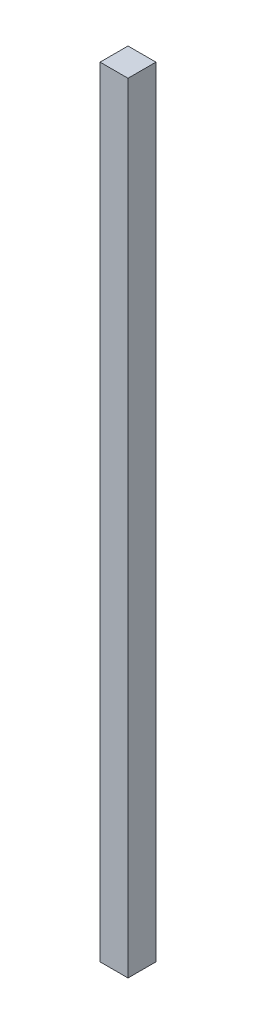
ISO-10303-21;
HEADER;
FILE_DESCRIPTION(('STEP AP214'),'2;1');
FILE_NAME('part.step','',(''),(''),'','','');
FILE_SCHEMA(('AUTOMOTIVE_DESIGN { 1 0 10303 214 1 1 1 1 }'));
ENDSEC;
DATA;
#1=APPLICATION_CONTEXT('core data for automotive mechanical design processes');
#2=APPLICATION_PROTOCOL_DEFINITION('international standard','automotive_design',2000,#1);
#3=PRODUCT_CONTEXT('',#1,'mechanical');
#4=PRODUCT('Part','Part','',(#3));
#5=PRODUCT_RELATED_PRODUCT_CATEGORY('part','',(#4));
#6=PRODUCT_DEFINITION_FORMATION('','',#4);
#7=PRODUCT_DEFINITION_CONTEXT('part definition',#1,'design');
#8=PRODUCT_DEFINITION('design','',#6,#7);
#9=PRODUCT_DEFINITION_SHAPE('','',#8);
#10=(LENGTH_UNIT() NAMED_UNIT(*) SI_UNIT(.MILLI.,.METRE.));
#11=(NAMED_UNIT(*) PLANE_ANGLE_UNIT() SI_UNIT($,.RADIAN.));
#12=(NAMED_UNIT(*) SI_UNIT($,.STERADIAN.) SOLID_ANGLE_UNIT());
#13=UNCERTAINTY_MEASURE_WITH_UNIT(LENGTH_MEASURE(1.E-05),#10,'distance_accuracy_value','');
#14=(GEOMETRIC_REPRESENTATION_CONTEXT(3) GLOBAL_UNCERTAINTY_ASSIGNED_CONTEXT((#13)) GLOBAL_UNIT_ASSIGNED_CONTEXT((#10,
#11,#12)) REPRESENTATION_CONTEXT('',''));
#15=CARTESIAN_POINT('',(0.,0.,0.));
#16=DIRECTION('',(0.,0.,1.));
#17=DIRECTION('',(1.,0.,0.));
#18=AXIS2_PLACEMENT_3D('',#15,#16,#17);
#19=CARTESIAN_POINT('',(0.,0.,24.));
#20=DIRECTION('',(1.,0.,0.));
#21=DIRECTION('',(0.,0.,-1.));
#22=AXIS2_PLACEMENT_3D('',#19,#20,#21);
#23=PLANE('',#22);
#24=DIRECTION('',(0.,-1.,0.));
#25=VECTOR('',#24,1.);
#26=CARTESIAN_POINT('',(0.,0.,0.));
#27=LINE('',#26,#25);
#28=CARTESIAN_POINT('',(0.,670.,0.));
#29=VERTEX_POINT('',#28);
#30=CARTESIAN_POINT('',(0.,0.,0.));
#31=VERTEX_POINT('',#30);
#32=EDGE_CURVE('E96',#29,#31,#27,.T.);
#33=ORIENTED_EDGE('',*,*,#32,.T.);
#34=DIRECTION('',(0.,0.,-1.));
#35=VECTOR('',#34,1.);
#36=CARTESIAN_POINT('',(0.,0.,24.));
#37=LINE('',#36,#35);
#38=CARTESIAN_POINT('',(0.,0.,24.));
#39=VERTEX_POINT('',#38);
#40=EDGE_CURVE('E11',#39,#31,#37,.T.);
#41=ORIENTED_EDGE('',*,*,#40,.F.);
#42=DIRECTION('',(0.,-1.,0.));
#43=VECTOR('',#42,1.);
#44=CARTESIAN_POINT('',(0.,0.,24.));
#45=LINE('',#44,#43);
#46=CARTESIAN_POINT('',(0.,670.,24.));
#47=VERTEX_POINT('',#46);
#48=EDGE_CURVE('E84',#47,#39,#45,.T.);
#49=ORIENTED_EDGE('',*,*,#48,.F.);
#50=DIRECTION('',(0.,0.,-1.));
#51=VECTOR('',#50,1.);
#52=CARTESIAN_POINT('',(0.,670.,24.));
#53=LINE('',#52,#51);
#54=EDGE_CURVE('E92',#47,#29,#53,.T.);
#55=ORIENTED_EDGE('',*,*,#54,.T.);
#56=EDGE_LOOP('',(#33,#41,#49,#55));
#57=FACE_BOUND('',#56,.T.);
#58=ADVANCED_FACE('F33',(#57),#23,.F.);
#59=CARTESIAN_POINT('',(0.,0.,24.));
#60=DIRECTION('',(0.,1.,0.));
#61=DIRECTION('',(0.,0.,1.));
#62=AXIS2_PLACEMENT_3D('',#59,#60,#61);
#63=PLANE('',#62);
#64=DIRECTION('',(1.,0.,0.));
#65=VECTOR('',#64,1.);
#66=CARTESIAN_POINT('',(0.,0.,0.));
#67=LINE('',#66,#65);
#68=CARTESIAN_POINT('',(24.,0.,0.));
#69=VERTEX_POINT('',#68);
#70=EDGE_CURVE('E88',#31,#69,#67,.T.);
#71=ORIENTED_EDGE('',*,*,#70,.T.);
#72=DIRECTION('',(0.,0.,-1.));
#73=VECTOR('',#72,1.);
#74=CARTESIAN_POINT('',(24.,0.,24.));
#75=LINE('',#74,#73);
#76=CARTESIAN_POINT('',(24.,0.,24.));
#77=VERTEX_POINT('',#76);
#78=EDGE_CURVE('E41',#77,#69,#75,.T.);
#79=ORIENTED_EDGE('',*,*,#78,.F.);
#80=DIRECTION('',(1.,0.,0.));
#81=VECTOR('',#80,1.);
#82=CARTESIAN_POINT('',(0.,0.,24.));
#83=LINE('',#82,#81);
#84=EDGE_CURVE('E79',#39,#77,#83,.T.);
#85=ORIENTED_EDGE('',*,*,#84,.F.);
#86=ORIENTED_EDGE('',*,*,#40,.T.);
#87=EDGE_LOOP('',(#71,#79,#85,#86));
#88=FACE_BOUND('',#87,.T.);
#89=ADVANCED_FACE('F87',(#88),#63,.F.);
#90=CARTESIAN_POINT('',(24.,0.,24.));
#91=DIRECTION('',(-1.,0.,0.));
#92=DIRECTION('',(0.,0.,1.));
#93=AXIS2_PLACEMENT_3D('',#90,#91,#92);
#94=PLANE('',#93);
#95=DIRECTION('',(0.,1.,0.));
#96=VECTOR('',#95,1.);
#97=CARTESIAN_POINT('',(24.,0.,0.));
#98=LINE('',#97,#96);
#99=CARTESIAN_POINT('',(24.,670.,0.));
#100=VERTEX_POINT('',#99);
#101=EDGE_CURVE('E66',#69,#100,#98,.T.);
#102=ORIENTED_EDGE('',*,*,#101,.T.);
#103=DIRECTION('',(0.,0.,-1.));
#104=VECTOR('',#103,1.);
#105=CARTESIAN_POINT('',(24.,670.,24.));
#106=LINE('',#105,#104);
#107=CARTESIAN_POINT('',(24.,670.,24.));
#108=VERTEX_POINT('',#107);
#109=EDGE_CURVE('E89',#108,#100,#106,.T.);
#110=ORIENTED_EDGE('',*,*,#109,.F.);
#111=DIRECTION('',(0.,1.,0.));
#112=VECTOR('',#111,1.);
#113=CARTESIAN_POINT('',(24.,0.,24.));
#114=LINE('',#113,#112);
#115=EDGE_CURVE('E82',#77,#108,#114,.T.);
#116=ORIENTED_EDGE('',*,*,#115,.F.);
#117=ORIENTED_EDGE('',*,*,#78,.T.);
#118=EDGE_LOOP('',(#102,#110,#116,#117));
#119=FACE_BOUND('',#118,.T.);
#120=ADVANCED_FACE('F90',(#119),#94,.F.);
#121=CARTESIAN_POINT('',(0.,670.,24.));
#122=DIRECTION('',(0.,-1.,0.));
#123=DIRECTION('',(0.,0.,-1.));
#124=AXIS2_PLACEMENT_3D('',#121,#122,#123);
#125=PLANE('',#124);
#126=DIRECTION('',(-1.,0.,0.));
#127=VECTOR('',#126,1.);
#128=CARTESIAN_POINT('',(0.,670.,0.));
#129=LINE('',#128,#127);
#130=EDGE_CURVE('E72',#100,#29,#129,.T.);
#131=ORIENTED_EDGE('',*,*,#130,.T.);
#132=ORIENTED_EDGE('',*,*,#54,.F.);
#133=DIRECTION('',(-1.,0.,0.));
#134=VECTOR('',#133,1.);
#135=CARTESIAN_POINT('',(0.,670.,24.));
#136=LINE('',#135,#134);
#137=EDGE_CURVE('E49',#108,#47,#136,.T.);
#138=ORIENTED_EDGE('',*,*,#137,.F.);
#139=ORIENTED_EDGE('',*,*,#109,.T.);
#140=EDGE_LOOP('',(#131,#132,#138,#139));
#141=FACE_BOUND('',#140,.T.);
#142=ADVANCED_FACE('F103',(#141),#125,.F.);
#143=CARTESIAN_POINT('',(0.,670.,24.));
#144=DIRECTION('',(0.,0.,-1.));
#145=DIRECTION('',(-1.,0.,0.));
#146=AXIS2_PLACEMENT_3D('',#143,#144,#145);
#147=PLANE('',#146);
#148=ORIENTED_EDGE('',*,*,#48,.T.);
#149=ORIENTED_EDGE('',*,*,#84,.T.);
#150=ORIENTED_EDGE('',*,*,#115,.T.);
#151=ORIENTED_EDGE('',*,*,#137,.T.);
#152=EDGE_LOOP('',(#148,#149,#150,#151));
#153=FACE_BOUND('',#152,.T.);
#154=ADVANCED_FACE('F80',(#153),#147,.F.);
#155=CARTESIAN_POINT('',(0.,670.,0.));
#156=DIRECTION('',(0.,0.,-1.));
#157=DIRECTION('',(-1.,0.,0.));
#158=AXIS2_PLACEMENT_3D('',#155,#156,#157);
#159=PLANE('',#158);
#160=ORIENTED_EDGE('',*,*,#32,.F.);
#161=ORIENTED_EDGE('',*,*,#130,.F.);
#162=ORIENTED_EDGE('',*,*,#101,.F.);
#163=ORIENTED_EDGE('',*,*,#70,.F.);
#164=EDGE_LOOP('',(#160,#161,#162,#163));
#165=FACE_BOUND('',#164,.T.);
#166=ADVANCED_FACE('F106',(#165),#159,.T.);
#167=CLOSED_SHELL('',(#58,#89,#120,#142,#154,#166));
#168=MANIFOLD_SOLID_BREP('B2',#167);
#169=ADVANCED_BREP_SHAPE_REPRESENTATION('',(#18,#168),#14);
#170=SHAPE_DEFINITION_REPRESENTATION(#9,#169);
ENDSEC;
END-ISO-10303-21;
